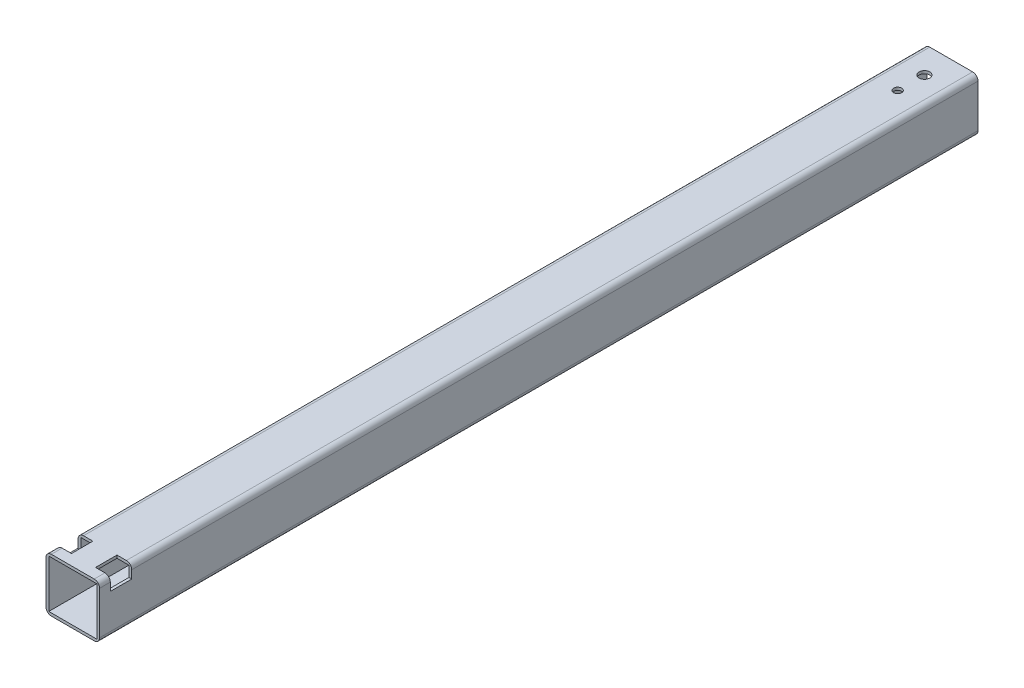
from build123d import *

# Parameters (mm, degrees)
SKETCH1_W           = 31.75
SKETCH1_H           = 31.75
SKETCH1_W_2         = 28.448
SKETCH1_H_2         = 28.448
EXTRUDE_THIN1_DEPTH = 520.7
FILLET1_R           = 3.175
SKETCH2_R           = 3.175
SKETCH2_R_2         = 2.3876
CUT_EXTRUDE1_DEPTH  = 25.4
CUT_EXTRUDE2_START  = 7.9248
SKETCH4_W           = 12.7
SKETCH4_H           = 12.7
CUT_EXTRUDE2_DEPTH  = 25.4
SKETCH5_R           = 2.3876
CUT_EXTRUDE3_DEPTH  = 25.4


with BuildPart() as part:
    # Sketch1 → Extrude-Thin1 (new body)
    with BuildSketch(Plane.XY):
        Rectangle(SKETCH1_W, SKETCH1_H)
        Rectangle(SKETCH1_W_2, SKETCH1_H_2, mode=Mode.SUBTRACT)
    extrude(amount=EXTRUDE_THIN1_DEPTH)

    # Fillet1
    fillet1_edges = [part.edges().sort_by_distance(p)[0] for p in [
        (-15.875, 15.875, 260.35),
        (15.875, 15.875, 260.35),
        (15.875, -15.875, 260.35),
        (-15.875, -15.875, 260.35),
    ]]
    fillet(fillet1_edges, radius=FILLET1_R)

    # Sketch2 → Cut-Extrude1 (cut, symmetric)
    with BuildSketch(Plane(origin=(0, 0, 0), x_dir=(1, 0, 0), z_dir=(0, 1, 0))):
        with Locations(Location((0, -15.875, 0), (0, 0, 90))):
            Circle(SKETCH2_R)
        with Locations(Location((0, -31.75, 0), (0, 0, 90))):
            Circle(SKETCH2_R_2)
    extrude(amount=CUT_EXTRUDE1_DEPTH, both=True, mode=Mode.SUBTRACT)

    # Sketch4 → Cut-Extrude2 (cut)
    with BuildSketch(Plane(origin=(0, 0, 0), x_dir=(1, 0, 0), z_dir=(0, 1, 0)).offset(CUT_EXTRUDE2_START)):
        with Locations((13.4874, -508)):
            Rectangle(SKETCH4_W, SKETCH4_H)
        with Locations((-13.4874, -508)):
            Rectangle(SKETCH4_W, SKETCH4_H)
    extrude(amount=CUT_EXTRUDE2_DEPTH, mode=Mode.SUBTRACT)

    # Sketch5 → Cut-Extrude3 (cut)
    with BuildSketch(Plane(origin=(0, 0, 0), x_dir=(1, 0, 0), z_dir=(0, 1, 0))):
        with Locations(Location((0, -495.3, 0), (0, 0, 270))):
            Circle(SKETCH5_R)
    extrude(amount=-CUT_EXTRUDE3_DEPTH, mode=Mode.SUBTRACT)


solid = part.part
